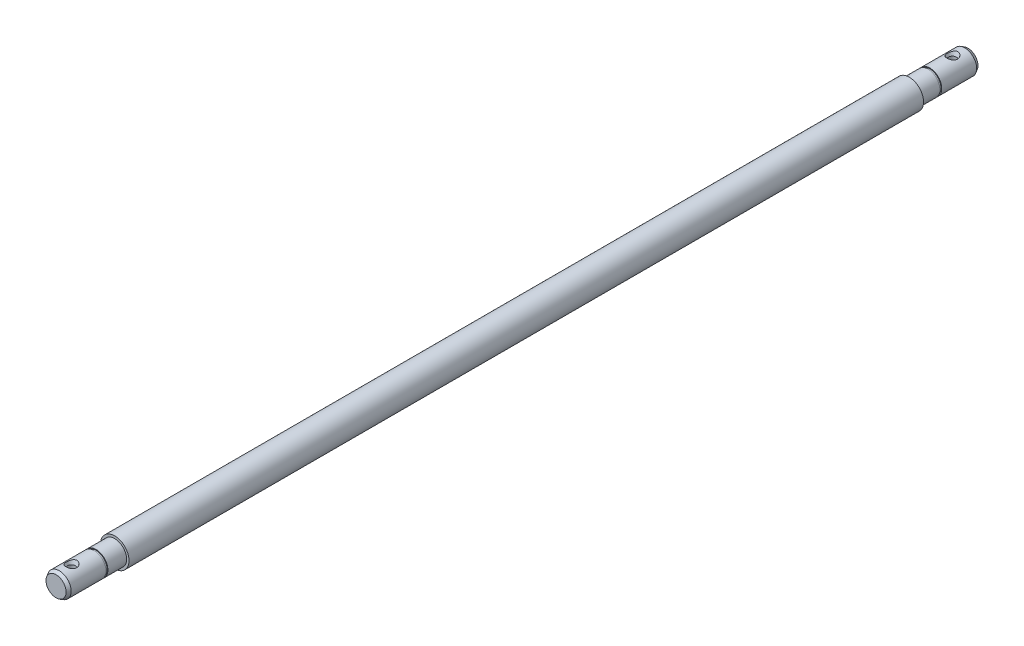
from build123d import *

# Parameters (mm, degrees)
ESQUISSE1_R                   = 7.5
EXTRUSION1_DEPTH              = 287.5
CHANFREIN1_SIZE               = 2
CHANFREIN1_SIZE2              = 1.154700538
ESQUISSE4_W                   = 0.5
ESQUISSE4_H                   = 1.2
ESQUISSE5_R                   = 9
EXTRUSION2_DEPTH              = 250.5
CHANFREIN1_OF_SYM_TRIE3_SIZE2 = 1.154700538
CHANFREIN1_OF_SYM_TRIE3_SIZE  = 2


with BuildPart() as part:
    # Esquisse1 → Extrusion1 (new body)
    with BuildSketch(Plane.XY):
        Circle(ESQUISSE1_R)
    extrusion1 = extrude(amount=EXTRUSION1_DEPTH)

    # Chanfrein1
    chanfrein1_edges = [part.edges().sort_by_distance(p)[0] for p in [
        (-7.5, 0, 0),
    ]]
    chanfrein1_side = [part.faces().sort_by_distance(p)[0] for p in [
        (-7.5, 0, 143.75),
    ]]
    chamfer(chanfrein1_edges, length=CHANFREIN1_SIZE, length2=CHANFREIN1_SIZE2, reference=chanfrein1_side[0])

    # Esquisse2 → Trou taraud_ M61 (revolve, cut)
    with BuildSketch(Plane(origin=(0, 7.5, 9.75), x_dir=(0, 0, 1), z_dir=(1, 0, 0))):
        Polygon((0, 0), (0, 15), (3.5, 15), (2.5, 12.585786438), (2.5, 2.414213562), (3.5, 0), align=None)
    trou_taraud_m61 = revolve(axis=Axis((0, 13.85, 9.75), (0, -1, 0)), mode=Mode.SUBTRACT)

    # Esquisse4 → Enl_vement de mati_re-R_volution1 (revolve, cut)
    with BuildSketch(Plane(origin=(0, 0, 0), x_dir=(1, 0, 0), z_dir=(0, 1, 0)), mode=Mode.PRIVATE) as enl_vement_de_mati_re_r_volution1_sk:
        with Locations((7.25, -24.6)):
            Rectangle(ESQUISSE4_W, ESQUISSE4_H)
    enl_vement_de_mati_re_r_volution1 = revolve(enl_vement_de_mati_re_r_volution1_sk.sketch.rotate(Axis((0, 0, 0), (0, 0, 1)), 180), axis=Axis((0, 0, 0), (0, 0, 1)), mode=Mode.SUBTRACT)

    # Esquisse5 → Extrusion2 (add)
    with BuildSketch(Plane.XY.offset(287.5)):
        Circle(ESQUISSE5_R)
    extrusion2 = extrude(amount=-EXTRUSION2_DEPTH)

    # Sym_trie3: Extrusion1, Trou taraud_ M61, Enl_vement de mati_re-R_volution1, Extrusion2 across plane
    add(extrusion1.mirror(Plane.XY.offset(287.5)))
    add(trou_taraud_m61.mirror(Plane.XY.offset(287.5)), mode=Mode.SUBTRACT)
    add(enl_vement_de_mati_re_r_volution1.mirror(Plane.XY.offset(287.5)), mode=Mode.SUBTRACT)
    add(extrusion2.mirror(Plane.XY.offset(287.5)))

    # Chanfrein1 of Sym_trie3
    chanfrein1_of_sym_trie3_edges = [part.edges().sort_by_distance(p)[0] for p in [
        (-7.5, 0, 575),
    ]]
    chamfer(chanfrein1_of_sym_trie3_edges, length=CHANFREIN1_OF_SYM_TRIE3_SIZE, length2=CHANFREIN1_OF_SYM_TRIE3_SIZE2)


solid = part.part
